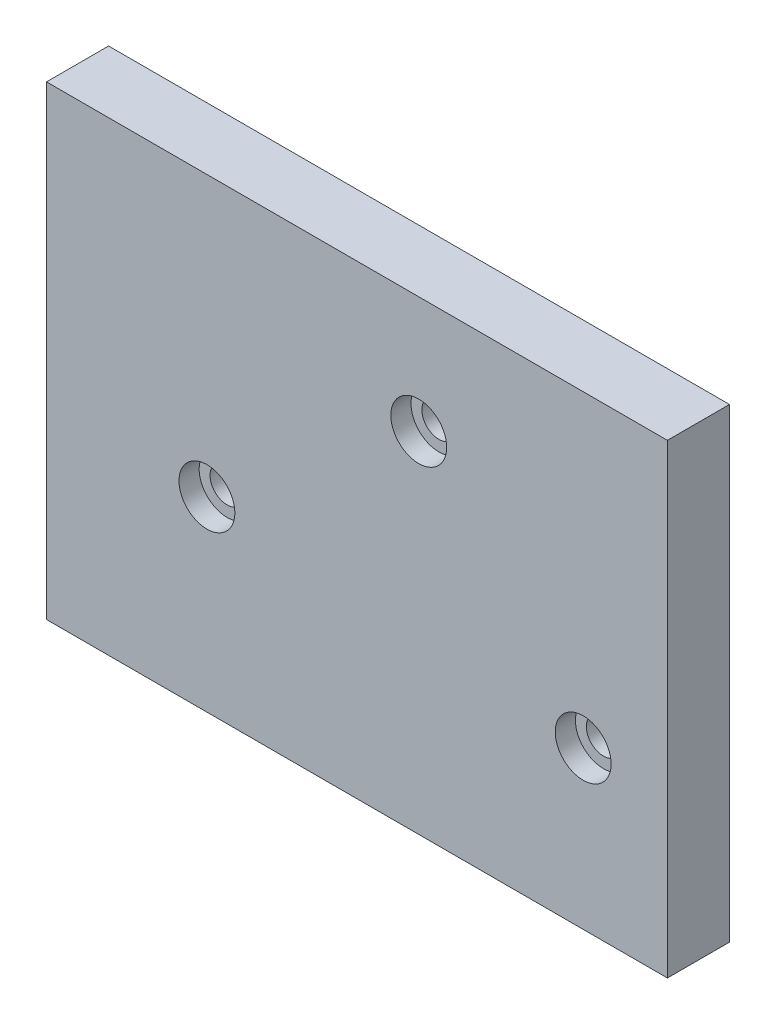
ISO-10303-21;
HEADER;
FILE_DESCRIPTION(('STEP AP214'),'2;1');
FILE_NAME('part.step','',(''),(''),'','','');
FILE_SCHEMA(('AUTOMOTIVE_DESIGN { 1 0 10303 214 1 1 1 1 }'));
ENDSEC;
DATA;
#1=APPLICATION_CONTEXT('core data for automotive mechanical design processes');
#2=APPLICATION_PROTOCOL_DEFINITION('international standard','automotive_design',2000,#1);
#3=PRODUCT_CONTEXT('',#1,'mechanical');
#4=PRODUCT('Part','Part','',(#3));
#5=PRODUCT_RELATED_PRODUCT_CATEGORY('part','',(#4));
#6=PRODUCT_DEFINITION_FORMATION('','',#4);
#7=PRODUCT_DEFINITION_CONTEXT('part definition',#1,'design');
#8=PRODUCT_DEFINITION('design','',#6,#7);
#9=PRODUCT_DEFINITION_SHAPE('','',#8);
#10=(LENGTH_UNIT() NAMED_UNIT(*) SI_UNIT(.MILLI.,.METRE.));
#11=(NAMED_UNIT(*) PLANE_ANGLE_UNIT() SI_UNIT($,.RADIAN.));
#12=(NAMED_UNIT(*) SI_UNIT($,.STERADIAN.) SOLID_ANGLE_UNIT());
#13=UNCERTAINTY_MEASURE_WITH_UNIT(LENGTH_MEASURE(1.E-05),#10,'distance_accuracy_value','');
#14=(GEOMETRIC_REPRESENTATION_CONTEXT(3) GLOBAL_UNCERTAINTY_ASSIGNED_CONTEXT((#13)) GLOBAL_UNIT_ASSIGNED_CONTEXT((#10,
#11,#12)) REPRESENTATION_CONTEXT('',''));
#15=CARTESIAN_POINT('',(0.,0.,0.));
#16=DIRECTION('',(0.,0.,1.));
#17=DIRECTION('',(1.,0.,0.));
#18=AXIS2_PLACEMENT_3D('',#15,#16,#17);
#19=CARTESIAN_POINT('',(-100.,75.,20.));
#20=DIRECTION('',(1.,0.,0.));
#21=DIRECTION('',(0.,1.,0.));
#22=AXIS2_PLACEMENT_3D('',#19,#20,#21);
#23=PLANE('',#22);
#24=DIRECTION('',(0.,-1.,0.));
#25=VECTOR('',#24,1.);
#26=CARTESIAN_POINT('',(-100.,75.,0.));
#27=LINE('',#26,#25);
#28=CARTESIAN_POINT('',(-100.,75.,0.));
#29=VERTEX_POINT('',#28);
#30=CARTESIAN_POINT('',(-100.,-75.,0.));
#31=VERTEX_POINT('',#30);
#32=EDGE_CURVE('E75',#29,#31,#27,.T.);
#33=ORIENTED_EDGE('',*,*,#32,.T.);
#34=DIRECTION('',(0.,0.,-1.));
#35=VECTOR('',#34,1.);
#36=CARTESIAN_POINT('',(-100.,-75.,20.));
#37=LINE('',#36,#35);
#38=CARTESIAN_POINT('',(-100.,-75.,20.));
#39=VERTEX_POINT('',#38);
#40=EDGE_CURVE('E11',#39,#31,#37,.T.);
#41=ORIENTED_EDGE('',*,*,#40,.F.);
#42=DIRECTION('',(0.,-1.,0.));
#43=VECTOR('',#42,1.);
#44=CARTESIAN_POINT('',(-100.,75.,20.));
#45=LINE('',#44,#43);
#46=CARTESIAN_POINT('',(-100.,75.,20.));
#47=VERTEX_POINT('',#46);
#48=EDGE_CURVE('E98',#47,#39,#45,.T.);
#49=ORIENTED_EDGE('',*,*,#48,.F.);
#50=DIRECTION('',(0.,0.,-1.));
#51=VECTOR('',#50,1.);
#52=CARTESIAN_POINT('',(-100.,75.,20.));
#53=LINE('',#52,#51);
#54=EDGE_CURVE('E87',#47,#29,#53,.T.);
#55=ORIENTED_EDGE('',*,*,#54,.T.);
#56=EDGE_LOOP('',(#33,#41,#49,#55));
#57=FACE_BOUND('',#56,.T.);
#58=ADVANCED_FACE('F31',(#57),#23,.F.);
#59=CARTESIAN_POINT('',(-100.,-75.,20.));
#60=DIRECTION('',(0.,1.,0.));
#61=DIRECTION('',(0.,0.,1.));
#62=AXIS2_PLACEMENT_3D('',#59,#60,#61);
#63=PLANE('',#62);
#64=DIRECTION('',(1.,0.,0.));
#65=VECTOR('',#64,1.);
#66=CARTESIAN_POINT('',(-100.,-75.,0.));
#67=LINE('',#66,#65);
#68=CARTESIAN_POINT('',(100.,-75.,0.));
#69=VERTEX_POINT('',#68);
#70=EDGE_CURVE('E71',#31,#69,#67,.T.);
#71=ORIENTED_EDGE('',*,*,#70,.T.);
#72=DIRECTION('',(0.,0.,-1.));
#73=VECTOR('',#72,1.);
#74=CARTESIAN_POINT('',(100.,-75.,20.));
#75=LINE('',#74,#73);
#76=CARTESIAN_POINT('',(100.,-75.,20.));
#77=VERTEX_POINT('',#76);
#78=EDGE_CURVE('E38',#77,#69,#75,.T.);
#79=ORIENTED_EDGE('',*,*,#78,.F.);
#80=DIRECTION('',(1.,0.,0.));
#81=VECTOR('',#80,1.);
#82=CARTESIAN_POINT('',(-100.,-75.,20.));
#83=LINE('',#82,#81);
#84=EDGE_CURVE('E83',#39,#77,#83,.T.);
#85=ORIENTED_EDGE('',*,*,#84,.F.);
#86=ORIENTED_EDGE('',*,*,#40,.T.);
#87=EDGE_LOOP('',(#71,#79,#85,#86));
#88=FACE_BOUND('',#87,.T.);
#89=ADVANCED_FACE('F82',(#88),#63,.F.);
#90=CARTESIAN_POINT('',(100.,75.,20.));
#91=DIRECTION('',(-1.,0.,0.));
#92=DIRECTION('',(0.,-1.,0.));
#93=AXIS2_PLACEMENT_3D('',#90,#91,#92);
#94=PLANE('',#93);
#95=DIRECTION('',(0.,1.,0.));
#96=VECTOR('',#95,1.);
#97=CARTESIAN_POINT('',(100.,75.,0.));
#98=LINE('',#97,#96);
#99=CARTESIAN_POINT('',(100.,75.,0.));
#100=VERTEX_POINT('',#99);
#101=EDGE_CURVE('E76',#69,#100,#98,.T.);
#102=ORIENTED_EDGE('',*,*,#101,.T.);
#103=DIRECTION('',(0.,0.,-1.));
#104=VECTOR('',#103,1.);
#105=CARTESIAN_POINT('',(100.,75.,20.));
#106=LINE('',#105,#104);
#107=CARTESIAN_POINT('',(100.,75.,20.));
#108=VERTEX_POINT('',#107);
#109=EDGE_CURVE('E104',#108,#100,#106,.T.);
#110=ORIENTED_EDGE('',*,*,#109,.F.);
#111=DIRECTION('',(0.,1.,0.));
#112=VECTOR('',#111,1.);
#113=CARTESIAN_POINT('',(100.,75.,20.));
#114=LINE('',#113,#112);
#115=EDGE_CURVE('E50',#77,#108,#114,.T.);
#116=ORIENTED_EDGE('',*,*,#115,.F.);
#117=ORIENTED_EDGE('',*,*,#78,.T.);
#118=EDGE_LOOP('',(#102,#110,#116,#117));
#119=FACE_BOUND('',#118,.T.);
#120=ADVANCED_FACE('F107',(#119),#94,.F.);
#121=CARTESIAN_POINT('',(-100.,75.,20.));
#122=DIRECTION('',(0.,-1.,0.));
#123=DIRECTION('',(0.,0.,-1.));
#124=AXIS2_PLACEMENT_3D('',#121,#122,#123);
#125=PLANE('',#124);
#126=DIRECTION('',(-1.,0.,0.));
#127=VECTOR('',#126,1.);
#128=CARTESIAN_POINT('',(-100.,75.,0.));
#129=LINE('',#128,#127);
#130=EDGE_CURVE('E96',#100,#29,#129,.T.);
#131=ORIENTED_EDGE('',*,*,#130,.T.);
#132=ORIENTED_EDGE('',*,*,#54,.F.);
#133=DIRECTION('',(-1.,0.,0.));
#134=VECTOR('',#133,1.);
#135=CARTESIAN_POINT('',(-100.,75.,20.));
#136=LINE('',#135,#134);
#137=EDGE_CURVE('E45',#108,#47,#136,.T.);
#138=ORIENTED_EDGE('',*,*,#137,.F.);
#139=ORIENTED_EDGE('',*,*,#109,.T.);
#140=EDGE_LOOP('',(#131,#132,#138,#139));
#141=FACE_BOUND('',#140,.T.);
#142=ADVANCED_FACE('F109',(#141),#125,.F.);
#143=CARTESIAN_POINT('',(-100.,-75.,20.));
#144=DIRECTION('',(0.,0.,1.));
#145=DIRECTION('',(1.,0.,0.));
#146=AXIS2_PLACEMENT_3D('',#143,#144,#145);
#147=PLANE('',#146);
#148=CARTESIAN_POINT('',(-48.3307566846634,-14.9409518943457,20.));
#149=DIRECTION('',(0.,0.,1.));
#150=DIRECTION('',(1.,0.,0.));
#151=AXIS2_PLACEMENT_3D('',#148,#149,#150);
#152=CIRCLE('',#151,8.99999999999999);
#153=CARTESIAN_POINT('',(-39.3307566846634,-14.9409518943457,20.));
#154=VERTEX_POINT('',#153);
#155=EDGE_CURVE('E251',#154,#154,#152,.T.);
#156=ORIENTED_EDGE('',*,*,#155,.F.);
#157=EDGE_LOOP('',(#156));
#158=FACE_BOUND('',#157,.T.);
#159=CARTESIAN_POINT('',(19.9030275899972,37.4630529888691,20.));
#160=DIRECTION('',(0.,0.,1.));
#161=DIRECTION('',(1.,0.,0.));
#162=AXIS2_PLACEMENT_3D('',#159,#160,#161);
#163=CIRCLE('',#162,9.);
#164=CARTESIAN_POINT('',(28.9030275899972,37.4630529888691,20.));
#165=VERTEX_POINT('',#164);
#166=EDGE_CURVE('E266',#165,#165,#163,.T.);
#167=ORIENTED_EDGE('',*,*,#166,.F.);
#168=EDGE_LOOP('',(#167));
#169=FACE_BOUND('',#168,.T.);
#170=CARTESIAN_POINT('',(72.8705824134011,-24.4007237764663,20.));
#171=DIRECTION('',(0.,0.,1.));
#172=DIRECTION('',(1.,0.,0.));
#173=AXIS2_PLACEMENT_3D('',#170,#171,#172);
#174=CIRCLE('',#173,8.99999999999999);
#175=CARTESIAN_POINT('',(81.8705824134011,-24.4007237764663,20.));
#176=VERTEX_POINT('',#175);
#177=EDGE_CURVE('E88',#176,#176,#174,.T.);
#178=ORIENTED_EDGE('',*,*,#177,.F.);
#179=EDGE_LOOP('',(#178));
#180=FACE_BOUND('',#179,.T.);
#181=ORIENTED_EDGE('',*,*,#48,.T.);
#182=ORIENTED_EDGE('',*,*,#84,.T.);
#183=ORIENTED_EDGE('',*,*,#115,.T.);
#184=ORIENTED_EDGE('',*,*,#137,.T.);
#185=EDGE_LOOP('',(#181,#182,#183,#184));
#186=FACE_BOUND('',#185,.T.);
#187=ADVANCED_FACE('F110',(#158,#169,#180,#186),#147,.T.);
#188=CARTESIAN_POINT('',(-100.,-75.,0.));
#189=DIRECTION('',(0.,0.,1.));
#190=DIRECTION('',(1.,0.,0.));
#191=AXIS2_PLACEMENT_3D('',#188,#189,#190);
#192=PLANE('',#191);
#193=CARTESIAN_POINT('',(-48.3307566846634,-14.9409518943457,0.));
#194=DIRECTION('',(0.,0.,1.));
#195=DIRECTION('',(1.,0.,0.));
#196=AXIS2_PLACEMENT_3D('',#193,#194,#195);
#197=CIRCLE('',#196,5.5);
#198=CARTESIAN_POINT('',(-42.8307566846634,-14.9409518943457,0.));
#199=VERTEX_POINT('',#198);
#200=EDGE_CURVE('E244',#199,#199,#197,.T.);
#201=ORIENTED_EDGE('',*,*,#200,.T.);
#202=EDGE_LOOP('',(#201));
#203=FACE_BOUND('',#202,.T.);
#204=CARTESIAN_POINT('',(19.9030275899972,37.4630529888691,0.));
#205=DIRECTION('',(0.,0.,1.));
#206=DIRECTION('',(1.,0.,0.));
#207=AXIS2_PLACEMENT_3D('',#204,#205,#206);
#208=CIRCLE('',#207,5.5);
#209=CARTESIAN_POINT('',(25.4030275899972,37.4630529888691,0.));
#210=VERTEX_POINT('',#209);
#211=EDGE_CURVE('E257',#210,#210,#208,.T.);
#212=ORIENTED_EDGE('',*,*,#211,.T.);
#213=EDGE_LOOP('',(#212));
#214=FACE_BOUND('',#213,.T.);
#215=CARTESIAN_POINT('',(72.8705824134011,-24.4007237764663,0.));
#216=DIRECTION('',(0.,0.,1.));
#217=DIRECTION('',(1.,0.,0.));
#218=AXIS2_PLACEMENT_3D('',#215,#216,#217);
#219=CIRCLE('',#218,5.49999999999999);
#220=CARTESIAN_POINT('',(78.370582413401,-24.4007237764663,0.));
#221=VERTEX_POINT('',#220);
#222=EDGE_CURVE('E269',#221,#221,#219,.T.);
#223=ORIENTED_EDGE('',*,*,#222,.T.);
#224=EDGE_LOOP('',(#223));
#225=FACE_BOUND('',#224,.T.);
#226=ORIENTED_EDGE('',*,*,#32,.F.);
#227=ORIENTED_EDGE('',*,*,#130,.F.);
#228=ORIENTED_EDGE('',*,*,#101,.F.);
#229=ORIENTED_EDGE('',*,*,#70,.F.);
#230=EDGE_LOOP('',(#226,#227,#228,#229));
#231=FACE_BOUND('',#230,.T.);
#232=ADVANCED_FACE('F72',(#203,#214,#225,#231),#192,.F.);
#233=CARTESIAN_POINT('',(72.8705824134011,-24.4007237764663,20.));
#234=DIRECTION('',(0.,0.,1.));
#235=DIRECTION('',(1.,0.,0.));
#236=AXIS2_PLACEMENT_3D('',#233,#234,#235);
#237=CYLINDRICAL_SURFACE('',#236,8.99999999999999);
#238=CARTESIAN_POINT('',(72.8705824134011,-24.4007237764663,13.5));
#239=DIRECTION('',(0.,0.,1.));
#240=DIRECTION('',(1.,0.,0.));
#241=AXIS2_PLACEMENT_3D('',#238,#239,#240);
#242=CIRCLE('',#241,8.99999999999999);
#243=CARTESIAN_POINT('',(81.8705824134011,-24.4007237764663,13.5));
#244=VERTEX_POINT('',#243);
#245=EDGE_CURVE('E91',#244,#244,#242,.T.);
#246=ORIENTED_EDGE('',*,*,#245,.F.);
#247=EDGE_LOOP('',(#246));
#248=FACE_BOUND('',#247,.T.);
#249=ORIENTED_EDGE('',*,*,#177,.T.);
#250=EDGE_LOOP('',(#249));
#251=FACE_BOUND('',#250,.T.);
#252=ADVANCED_FACE('F118',(#248,#251),#237,.F.);
#253=CARTESIAN_POINT('',(78.3705824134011,-24.4007237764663,13.5));
#254=DIRECTION('',(0.,0.,-1.));
#255=DIRECTION('',(-1.,0.,0.));
#256=AXIS2_PLACEMENT_3D('',#253,#254,#255);
#257=PLANE('',#256);
#258=CARTESIAN_POINT('',(72.8705824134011,-24.4007237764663,13.5));
#259=DIRECTION('',(0.,0.,1.));
#260=DIRECTION('',(1.,0.,0.));
#261=AXIS2_PLACEMENT_3D('',#258,#259,#260);
#262=CIRCLE('',#261,5.50000000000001);
#263=CARTESIAN_POINT('',(78.3705824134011,-24.4007237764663,13.5));
#264=VERTEX_POINT('',#263);
#265=EDGE_CURVE('E272',#264,#264,#262,.T.);
#266=ORIENTED_EDGE('',*,*,#265,.F.);
#267=EDGE_LOOP('',(#266));
#268=FACE_BOUND('',#267,.T.);
#269=ORIENTED_EDGE('',*,*,#245,.T.);
#270=EDGE_LOOP('',(#269));
#271=FACE_BOUND('',#270,.T.);
#272=ADVANCED_FACE('F157',(#268,#271),#257,.F.);
#273=CARTESIAN_POINT('',(72.8705824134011,-24.4007237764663,20.));
#274=DIRECTION('',(0.,0.,1.));
#275=DIRECTION('',(1.,0.,0.));
#276=AXIS2_PLACEMENT_3D('',#273,#274,#275);
#277=CYLINDRICAL_SURFACE('',#276,5.5);
#278=ORIENTED_EDGE('',*,*,#222,.F.);
#279=EDGE_LOOP('',(#278));
#280=FACE_BOUND('',#279,.T.);
#281=ORIENTED_EDGE('',*,*,#265,.T.);
#282=EDGE_LOOP('',(#281));
#283=FACE_BOUND('',#282,.T.);
#284=ADVANCED_FACE('F167',(#280,#283),#277,.F.);
#285=CARTESIAN_POINT('',(19.9030275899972,37.4630529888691,20.));
#286=DIRECTION('',(0.,0.,1.));
#287=DIRECTION('',(1.,0.,0.));
#288=AXIS2_PLACEMENT_3D('',#285,#286,#287);
#289=CYLINDRICAL_SURFACE('',#288,9.);
#290=CARTESIAN_POINT('',(19.9030275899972,37.4630529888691,13.5));
#291=DIRECTION('',(0.,0.,1.));
#292=DIRECTION('',(1.,0.,0.));
#293=AXIS2_PLACEMENT_3D('',#290,#291,#292);
#294=CIRCLE('',#293,9.);
#295=CARTESIAN_POINT('',(28.9030275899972,37.4630529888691,13.5));
#296=VERTEX_POINT('',#295);
#297=EDGE_CURVE('E263',#296,#296,#294,.T.);
#298=ORIENTED_EDGE('',*,*,#297,.F.);
#299=EDGE_LOOP('',(#298));
#300=FACE_BOUND('',#299,.T.);
#301=ORIENTED_EDGE('',*,*,#166,.T.);
#302=EDGE_LOOP('',(#301));
#303=FACE_BOUND('',#302,.T.);
#304=ADVANCED_FACE('F177',(#300,#303),#289,.F.);
#305=CARTESIAN_POINT('',(25.4030275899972,37.4630529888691,13.5));
#306=DIRECTION('',(0.,0.,-1.));
#307=DIRECTION('',(-1.,0.,0.));
#308=AXIS2_PLACEMENT_3D('',#305,#306,#307);
#309=PLANE('',#308);
#310=CARTESIAN_POINT('',(19.9030275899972,37.4630529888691,13.5));
#311=DIRECTION('',(0.,0.,1.));
#312=DIRECTION('',(1.,0.,0.));
#313=AXIS2_PLACEMENT_3D('',#310,#311,#312);
#314=CIRCLE('',#313,5.50000000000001);
#315=CARTESIAN_POINT('',(25.4030275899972,37.4630529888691,13.5));
#316=VERTEX_POINT('',#315);
#317=EDGE_CURVE('E260',#316,#316,#314,.T.);
#318=ORIENTED_EDGE('',*,*,#317,.F.);
#319=EDGE_LOOP('',(#318));
#320=FACE_BOUND('',#319,.T.);
#321=ORIENTED_EDGE('',*,*,#297,.T.);
#322=EDGE_LOOP('',(#321));
#323=FACE_BOUND('',#322,.T.);
#324=ADVANCED_FACE('F187',(#320,#323),#309,.F.);
#325=CARTESIAN_POINT('',(19.9030275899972,37.4630529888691,20.));
#326=DIRECTION('',(0.,0.,1.));
#327=DIRECTION('',(1.,0.,0.));
#328=AXIS2_PLACEMENT_3D('',#325,#326,#327);
#329=CYLINDRICAL_SURFACE('',#328,5.50000000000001);
#330=ORIENTED_EDGE('',*,*,#211,.F.);
#331=EDGE_LOOP('',(#330));
#332=FACE_BOUND('',#331,.T.);
#333=ORIENTED_EDGE('',*,*,#317,.T.);
#334=EDGE_LOOP('',(#333));
#335=FACE_BOUND('',#334,.T.);
#336=ADVANCED_FACE('F197',(#332,#335),#329,.F.);
#337=CARTESIAN_POINT('',(-48.3307566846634,-14.9409518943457,20.));
#338=DIRECTION('',(0.,0.,1.));
#339=DIRECTION('',(1.,0.,0.));
#340=AXIS2_PLACEMENT_3D('',#337,#338,#339);
#341=CYLINDRICAL_SURFACE('',#340,8.99999999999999);
#342=CARTESIAN_POINT('',(-48.3307566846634,-14.9409518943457,13.5));
#343=DIRECTION('',(0.,0.,1.));
#344=DIRECTION('',(1.,0.,0.));
#345=AXIS2_PLACEMENT_3D('',#342,#343,#344);
#346=CIRCLE('',#345,8.99999999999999);
#347=CARTESIAN_POINT('',(-39.3307566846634,-14.9409518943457,13.5));
#348=VERTEX_POINT('',#347);
#349=EDGE_CURVE('E248',#348,#348,#346,.T.);
#350=ORIENTED_EDGE('',*,*,#349,.F.);
#351=EDGE_LOOP('',(#350));
#352=FACE_BOUND('',#351,.T.);
#353=ORIENTED_EDGE('',*,*,#155,.T.);
#354=EDGE_LOOP('',(#353));
#355=FACE_BOUND('',#354,.T.);
#356=ADVANCED_FACE('F207',(#352,#355),#341,.F.);
#357=CARTESIAN_POINT('',(-42.8307566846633,-14.9409518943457,13.5));
#358=DIRECTION('',(0.,0.,-1.));
#359=DIRECTION('',(-1.,0.,0.));
#360=AXIS2_PLACEMENT_3D('',#357,#358,#359);
#361=PLANE('',#360);
#362=CARTESIAN_POINT('',(-48.3307566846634,-14.9409518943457,13.5));
#363=DIRECTION('',(0.,0.,1.));
#364=DIRECTION('',(1.,0.,0.));
#365=AXIS2_PLACEMENT_3D('',#362,#363,#364);
#366=CIRCLE('',#365,5.50000000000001);
#367=CARTESIAN_POINT('',(-42.8307566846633,-14.9409518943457,13.5));
#368=VERTEX_POINT('',#367);
#369=EDGE_CURVE('E247',#368,#368,#366,.T.);
#370=ORIENTED_EDGE('',*,*,#369,.F.);
#371=EDGE_LOOP('',(#370));
#372=FACE_BOUND('',#371,.T.);
#373=ORIENTED_EDGE('',*,*,#349,.T.);
#374=EDGE_LOOP('',(#373));
#375=FACE_BOUND('',#374,.T.);
#376=ADVANCED_FACE('F217',(#372,#375),#361,.F.);
#377=CARTESIAN_POINT('',(-48.3307566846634,-14.9409518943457,20.));
#378=DIRECTION('',(0.,0.,1.));
#379=DIRECTION('',(1.,0.,0.));
#380=AXIS2_PLACEMENT_3D('',#377,#378,#379);
#381=CYLINDRICAL_SURFACE('',#380,5.50000000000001);
#382=ORIENTED_EDGE('',*,*,#200,.F.);
#383=EDGE_LOOP('',(#382));
#384=FACE_BOUND('',#383,.T.);
#385=ORIENTED_EDGE('',*,*,#369,.T.);
#386=EDGE_LOOP('',(#385));
#387=FACE_BOUND('',#386,.T.);
#388=ADVANCED_FACE('F227',(#384,#387),#381,.F.);
#389=CLOSED_SHELL('',(#58,#89,#120,#142,#187,#232,#252,#272,#284,#304,#324,#336,#356,#376,#388));
#390=MANIFOLD_SOLID_BREP('B2',#389);
#391=ADVANCED_BREP_SHAPE_REPRESENTATION('',(#18,#390),#14);
#392=SHAPE_DEFINITION_REPRESENTATION(#9,#391);
ENDSEC;
END-ISO-10303-21;
